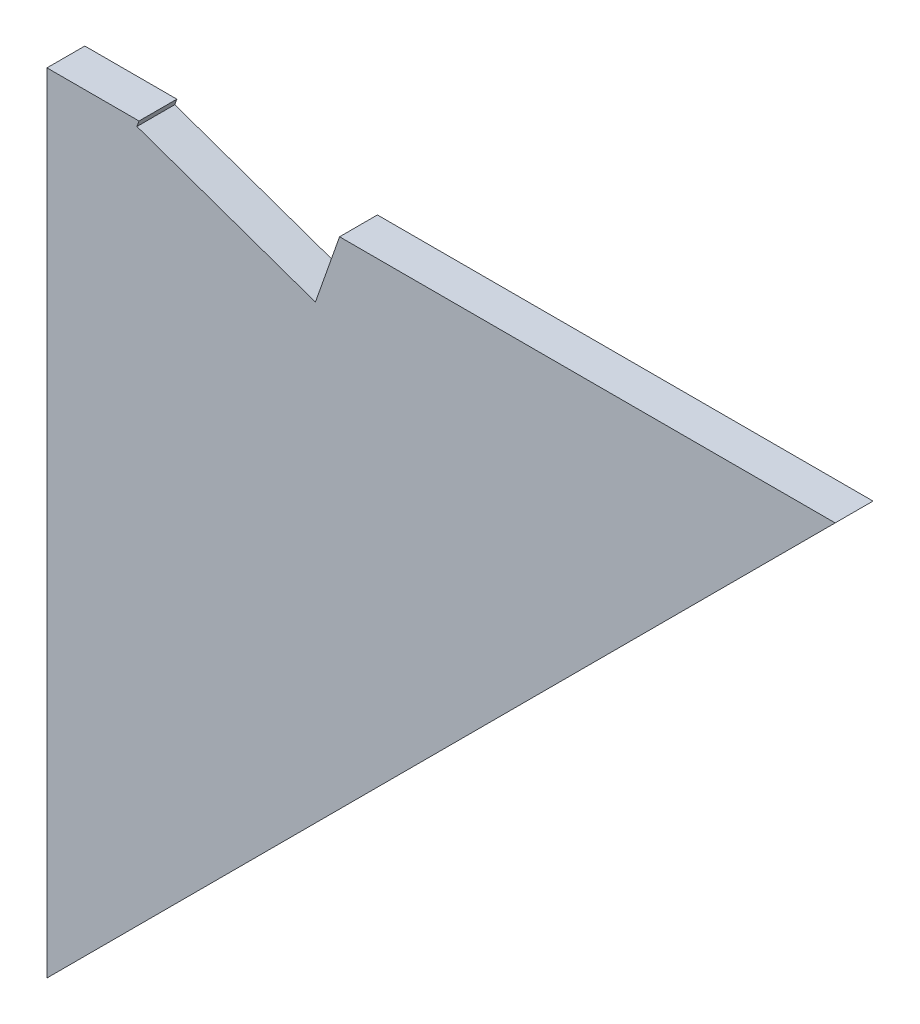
ISO-10303-21;
HEADER;
FILE_DESCRIPTION(('STEP AP214'),'2;1');
FILE_NAME('part.step','',(''),(''),'','','');
FILE_SCHEMA(('AUTOMOTIVE_DESIGN { 1 0 10303 214 1 1 1 1 }'));
ENDSEC;
DATA;
#1=APPLICATION_CONTEXT('core data for automotive mechanical design processes');
#2=APPLICATION_PROTOCOL_DEFINITION('international standard','automotive_design',2000,#1);
#3=PRODUCT_CONTEXT('',#1,'mechanical');
#4=PRODUCT('Part','Part','',(#3));
#5=PRODUCT_RELATED_PRODUCT_CATEGORY('part','',(#4));
#6=PRODUCT_DEFINITION_FORMATION('','',#4);
#7=PRODUCT_DEFINITION_CONTEXT('part definition',#1,'design');
#8=PRODUCT_DEFINITION('design','',#6,#7);
#9=PRODUCT_DEFINITION_SHAPE('','',#8);
#10=(LENGTH_UNIT() NAMED_UNIT(*) SI_UNIT(.MILLI.,.METRE.));
#11=(NAMED_UNIT(*) PLANE_ANGLE_UNIT() SI_UNIT($,.RADIAN.));
#12=(NAMED_UNIT(*) SI_UNIT($,.STERADIAN.) SOLID_ANGLE_UNIT());
#13=UNCERTAINTY_MEASURE_WITH_UNIT(LENGTH_MEASURE(1.E-05),#10,'distance_accuracy_value','');
#14=(GEOMETRIC_REPRESENTATION_CONTEXT(3) GLOBAL_UNCERTAINTY_ASSIGNED_CONTEXT((#13)) GLOBAL_UNIT_ASSIGNED_CONTEXT((#10,
#11,#12)) REPRESENTATION_CONTEXT('',''));
#15=CARTESIAN_POINT('',(0.,0.,0.));
#16=DIRECTION('',(0.,0.,1.));
#17=DIRECTION('',(1.,0.,0.));
#18=AXIS2_PLACEMENT_3D('',#15,#16,#17);
#19=CARTESIAN_POINT('',(28.540947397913,123.15383280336,36.001));
#20=DIRECTION('',(-0.332002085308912,-0.943278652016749,0.));
#21=DIRECTION('',(-0.943278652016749,0.332002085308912,0.));
#22=AXIS2_PLACEMENT_3D('',#19,#20,#21);
#23=PLANE('',#22);
#24=DIRECTION('',(-0.943278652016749,0.332002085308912,0.));
#25=VECTOR('',#24,1.);
#26=CARTESIAN_POINT('',(68.717524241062,109.01304072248,0.));
#27=LINE('',#26,#25);
#28=CARTESIAN_POINT('',(85.139553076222,103.23304368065,0.));
#29=VERTEX_POINT('',#28);
#30=CARTESIAN_POINT('',(28.540947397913,123.15383280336,0.));
#31=VERTEX_POINT('',#30);
#32=EDGE_CURVE('E91',#29,#31,#27,.T.);
#33=ORIENTED_EDGE('',*,*,#32,.T.);
#34=DIRECTION('',(0.,0.,-1.));
#35=VECTOR('',#34,1.);
#36=CARTESIAN_POINT('',(28.540947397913,123.15383280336,36.001));
#37=LINE('',#36,#35);
#38=CARTESIAN_POINT('',(28.540947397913,123.15383280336,12.));
#39=VERTEX_POINT('',#38);
#40=EDGE_CURVE('E24',#39,#31,#37,.T.);
#41=ORIENTED_EDGE('',*,*,#40,.F.);
#42=DIRECTION('',(-0.943278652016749,0.332002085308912,0.));
#43=VECTOR('',#42,1.);
#44=CARTESIAN_POINT('',(68.717524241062,109.01304072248,12.));
#45=LINE('',#44,#43);
#46=CARTESIAN_POINT('',(85.139553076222,103.23304368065,12.));
#47=VERTEX_POINT('',#46);
#48=EDGE_CURVE('E134',#47,#39,#45,.T.);
#49=ORIENTED_EDGE('',*,*,#48,.F.);
#50=DIRECTION('',(0.,0.,-1.));
#51=VECTOR('',#50,1.);
#52=CARTESIAN_POINT('',(85.139553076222,103.23304368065,36.001));
#53=LINE('',#52,#51);
#54=EDGE_CURVE('E10',#47,#29,#53,.T.);
#55=ORIENTED_EDGE('',*,*,#54,.T.);
#56=EDGE_LOOP('',(#33,#41,#49,#55));
#57=FACE_BOUND('',#56,.T.);
#58=ADVANCED_FACE('F16',(#57),#23,.F.);
#59=CARTESIAN_POINT('',(1871.631304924,5178.982884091,36.001));
#60=DIRECTION('',(0.943278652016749,-0.332002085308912,0.));
#61=DIRECTION('',(0.,0.,-1.));
#62=AXIS2_PLACEMENT_3D('',#59,#60,#61);
#63=PLANE('',#62);
#64=DIRECTION('',(-0.332002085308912,-0.943278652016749,0.));
#65=VECTOR('',#64,1.);
#66=CARTESIAN_POINT('',(968.13255228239,2611.977665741,12.));
#67=LINE('',#66,#65);
#68=CARTESIAN_POINT('',(92.800783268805,125.,12.));
#69=VERTEX_POINT('',#68);
#70=EDGE_CURVE('E70',#69,#47,#67,.T.);
#71=ORIENTED_EDGE('',*,*,#70,.F.);
#72=DIRECTION('',(0.,0.,-1.));
#73=VECTOR('',#72,1.);
#74=CARTESIAN_POINT('',(92.800783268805,124.99999999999,18.0005));
#75=LINE('',#74,#73);
#76=CARTESIAN_POINT('',(92.800783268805,125.,0.));
#77=VERTEX_POINT('',#76);
#78=EDGE_CURVE('E63',#69,#77,#75,.T.);
#79=ORIENTED_EDGE('',*,*,#78,.T.);
#80=DIRECTION('',(-0.332002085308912,-0.943278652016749,0.));
#81=VECTOR('',#80,1.);
#82=CARTESIAN_POINT('',(968.13255228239,2611.977665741,0.));
#83=LINE('',#82,#81);
#84=EDGE_CURVE('E67',#77,#29,#83,.T.);
#85=ORIENTED_EDGE('',*,*,#84,.T.);
#86=ORIENTED_EDGE('',*,*,#54,.F.);
#87=EDGE_LOOP('',(#71,#79,#85,#86));
#88=FACE_BOUND('',#87,.T.);
#89=ADVANCED_FACE('F65',(#88),#63,.F.);
#90=CARTESIAN_POINT('',(1815.032699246,5198.903673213,36.001));
#91=DIRECTION('',(0.943278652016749,-0.332002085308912,0.));
#92=DIRECTION('',(0.,0.,-1.));
#93=AXIS2_PLACEMENT_3D('',#90,#91,#92);
#94=PLANE('',#93);
#95=ORIENTED_EDGE('',*,*,#40,.T.);
#96=DIRECTION('',(-0.332002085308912,-0.943278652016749,0.));
#97=VECTOR('',#96,1.);
#98=CARTESIAN_POINT('',(911.53394660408,2631.898454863,0.));
#99=LINE('',#98,#97);
#100=CARTESIAN_POINT('',(29.190735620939,125.,0.));
#101=VERTEX_POINT('',#100);
#102=EDGE_CURVE('E98',#101,#31,#99,.T.);
#103=ORIENTED_EDGE('',*,*,#102,.F.);
#104=DIRECTION('',(0.,0.,-1.));
#105=VECTOR('',#104,1.);
#106=CARTESIAN_POINT('',(29.190735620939,125.,18.0005));
#107=LINE('',#106,#105);
#108=CARTESIAN_POINT('',(29.190735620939,125.,12.));
#109=VERTEX_POINT('',#108);
#110=EDGE_CURVE('E126',#109,#101,#107,.T.);
#111=ORIENTED_EDGE('',*,*,#110,.F.);
#112=DIRECTION('',(-0.332002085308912,-0.943278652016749,0.));
#113=VECTOR('',#112,1.);
#114=CARTESIAN_POINT('',(911.53394660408,2631.898454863,12.));
#115=LINE('',#114,#113);
#116=EDGE_CURVE('E75',#109,#39,#115,.T.);
#117=ORIENTED_EDGE('',*,*,#116,.T.);
#118=EDGE_LOOP('',(#95,#103,#111,#117));
#119=FACE_BOUND('',#118,.T.);
#120=ADVANCED_FACE('F142',(#119),#94,.T.);
#121=CARTESIAN_POINT('',(0.,125.,0.));
#122=DIRECTION('',(0.,1.,0.));
#123=DIRECTION('',(1.,0.,0.));
#124=AXIS2_PLACEMENT_3D('',#121,#122,#123);
#125=PLANE('',#124);
#126=DIRECTION('',(1.,0.,0.));
#127=VECTOR('',#126,1.);
#128=CARTESIAN_POINT('',(0.,125.,0.));
#129=LINE('',#128,#127);
#130=CARTESIAN_POINT('',(250.,125.,0.));
#131=VERTEX_POINT('',#130);
#132=EDGE_CURVE('E78',#77,#131,#129,.T.);
#133=ORIENTED_EDGE('',*,*,#132,.F.);
#134=ORIENTED_EDGE('',*,*,#78,.F.);
#135=DIRECTION('',(1.,0.,0.));
#136=VECTOR('',#135,1.);
#137=CARTESIAN_POINT('',(0.,125.,12.));
#138=LINE('',#137,#136);
#139=CARTESIAN_POINT('',(250.,125.,12.));
#140=VERTEX_POINT('',#139);
#141=EDGE_CURVE('E87',#69,#140,#138,.T.);
#142=ORIENTED_EDGE('',*,*,#141,.T.);
#143=DIRECTION('',(0.,0.,1.));
#144=VECTOR('',#143,1.);
#145=CARTESIAN_POINT('',(250.,125.,0.));
#146=LINE('',#145,#144);
#147=EDGE_CURVE('E82',#131,#140,#146,.T.);
#148=ORIENTED_EDGE('',*,*,#147,.F.);
#149=EDGE_LOOP('',(#133,#134,#142,#148));
#150=FACE_BOUND('',#149,.T.);
#151=ADVANCED_FACE('F79',(#150),#125,.T.);
#152=CARTESIAN_POINT('',(88.388347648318,36.611652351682,12.));
#153=DIRECTION('',(0.,0.,-1.));
#154=DIRECTION('',(0.,-1.,0.));
#155=AXIS2_PLACEMENT_3D('',#152,#153,#154);
#156=PLANE('',#155);
#157=ORIENTED_EDGE('',*,*,#141,.F.);
#158=ORIENTED_EDGE('',*,*,#70,.T.);
#159=ORIENTED_EDGE('',*,*,#48,.T.);
#160=ORIENTED_EDGE('',*,*,#116,.F.);
#161=DIRECTION('',(1.,0.,0.));
#162=VECTOR('',#161,1.);
#163=CARTESIAN_POINT('',(0.,125.,12.));
#164=LINE('',#163,#162);
#165=CARTESIAN_POINT('',(0.,125.,12.));
#166=VERTEX_POINT('',#165);
#167=EDGE_CURVE('E122',#166,#109,#164,.T.);
#168=ORIENTED_EDGE('',*,*,#167,.F.);
#169=DIRECTION('',(0.,1.,0.));
#170=VECTOR('',#169,1.);
#171=CARTESIAN_POINT('',(0.,-125.,12.));
#172=LINE('',#171,#170);
#173=CARTESIAN_POINT('',(0.,-125.,12.));
#174=VERTEX_POINT('',#173);
#175=EDGE_CURVE('E161',#174,#166,#172,.T.);
#176=ORIENTED_EDGE('',*,*,#175,.F.);
#177=DIRECTION('',(-0.707106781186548,-0.707106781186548,0.));
#178=VECTOR('',#177,1.);
#179=CARTESIAN_POINT('',(250.,125.,12.));
#180=LINE('',#179,#178);
#181=EDGE_CURVE('E107',#140,#174,#180,.T.);
#182=ORIENTED_EDGE('',*,*,#181,.F.);
#183=EDGE_LOOP('',(#157,#158,#159,#160,#168,#176,#182));
#184=FACE_BOUND('',#183,.T.);
#185=ADVANCED_FACE('F146',(#184),#156,.F.);
#186=CARTESIAN_POINT('',(88.388347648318,36.611652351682,0.));
#187=DIRECTION('',(0.,0.,-1.));
#188=DIRECTION('',(0.,-1.,0.));
#189=AXIS2_PLACEMENT_3D('',#186,#187,#188);
#190=PLANE('',#189);
#191=DIRECTION('',(-0.707106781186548,-0.707106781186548,0.));
#192=VECTOR('',#191,1.);
#193=CARTESIAN_POINT('',(250.,125.,0.));
#194=LINE('',#193,#192);
#195=CARTESIAN_POINT('',(0.,-125.,0.));
#196=VERTEX_POINT('',#195);
#197=EDGE_CURVE('E104',#131,#196,#194,.T.);
#198=ORIENTED_EDGE('',*,*,#197,.T.);
#199=DIRECTION('',(0.,1.,0.));
#200=VECTOR('',#199,1.);
#201=CARTESIAN_POINT('',(0.,-125.,0.));
#202=LINE('',#201,#200);
#203=CARTESIAN_POINT('',(0.,125.,0.));
#204=VERTEX_POINT('',#203);
#205=EDGE_CURVE('E108',#196,#204,#202,.T.);
#206=ORIENTED_EDGE('',*,*,#205,.T.);
#207=DIRECTION('',(1.,0.,0.));
#208=VECTOR('',#207,1.);
#209=CARTESIAN_POINT('',(0.,125.,0.));
#210=LINE('',#209,#208);
#211=EDGE_CURVE('E106',#204,#101,#210,.T.);
#212=ORIENTED_EDGE('',*,*,#211,.T.);
#213=ORIENTED_EDGE('',*,*,#102,.T.);
#214=ORIENTED_EDGE('',*,*,#32,.F.);
#215=ORIENTED_EDGE('',*,*,#84,.F.);
#216=ORIENTED_EDGE('',*,*,#132,.T.);
#217=EDGE_LOOP('',(#198,#206,#212,#213,#214,#215,#216));
#218=FACE_BOUND('',#217,.T.);
#219=ADVANCED_FACE('F89',(#218),#190,.T.);
#220=CARTESIAN_POINT('',(0.,125.,0.));
#221=DIRECTION('',(0.,1.,0.));
#222=DIRECTION('',(1.,0.,0.));
#223=AXIS2_PLACEMENT_3D('',#220,#221,#222);
#224=PLANE('',#223);
#225=ORIENTED_EDGE('',*,*,#211,.F.);
#226=DIRECTION('',(0.,0.,1.));
#227=VECTOR('',#226,1.);
#228=CARTESIAN_POINT('',(0.,125.,0.));
#229=LINE('',#228,#227);
#230=EDGE_CURVE('E102',#204,#166,#229,.T.);
#231=ORIENTED_EDGE('',*,*,#230,.T.);
#232=ORIENTED_EDGE('',*,*,#167,.T.);
#233=ORIENTED_EDGE('',*,*,#110,.T.);
#234=EDGE_LOOP('',(#225,#231,#232,#233));
#235=FACE_BOUND('',#234,.T.);
#236=ADVANCED_FACE('F152',(#235),#224,.T.);
#237=CARTESIAN_POINT('',(250.,125.,0.));
#238=DIRECTION('',(0.707106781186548,-0.707106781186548,0.));
#239=DIRECTION('',(0.,0.,-1.));
#240=AXIS2_PLACEMENT_3D('',#237,#238,#239);
#241=PLANE('',#240);
#242=ORIENTED_EDGE('',*,*,#147,.T.);
#243=ORIENTED_EDGE('',*,*,#181,.T.);
#244=DIRECTION('',(0.,0.,1.));
#245=VECTOR('',#244,1.);
#246=CARTESIAN_POINT('',(0.,-125.,0.));
#247=LINE('',#246,#245);
#248=EDGE_CURVE('E181',#196,#174,#247,.T.);
#249=ORIENTED_EDGE('',*,*,#248,.F.);
#250=ORIENTED_EDGE('',*,*,#197,.F.);
#251=EDGE_LOOP('',(#242,#243,#249,#250));
#252=FACE_BOUND('',#251,.T.);
#253=ADVANCED_FACE('F180',(#252),#241,.T.);
#254=CARTESIAN_POINT('',(0.,-125.,0.));
#255=DIRECTION('',(-1.,0.,0.));
#256=DIRECTION('',(0.,0.,1.));
#257=AXIS2_PLACEMENT_3D('',#254,#255,#256);
#258=PLANE('',#257);
#259=ORIENTED_EDGE('',*,*,#248,.T.);
#260=ORIENTED_EDGE('',*,*,#175,.T.);
#261=ORIENTED_EDGE('',*,*,#230,.F.);
#262=ORIENTED_EDGE('',*,*,#205,.F.);
#263=EDGE_LOOP('',(#259,#260,#261,#262));
#264=FACE_BOUND('',#263,.T.);
#265=ADVANCED_FACE('F185',(#264),#258,.T.);
#266=CLOSED_SHELL('',(#58,#89,#120,#151,#185,#219,#236,#253,#265));
#267=MANIFOLD_SOLID_BREP('B1',#266);
#268=ADVANCED_BREP_SHAPE_REPRESENTATION('',(#18,#267),#14);
#269=SHAPE_DEFINITION_REPRESENTATION(#9,#268);
ENDSEC;
END-ISO-10303-21;
